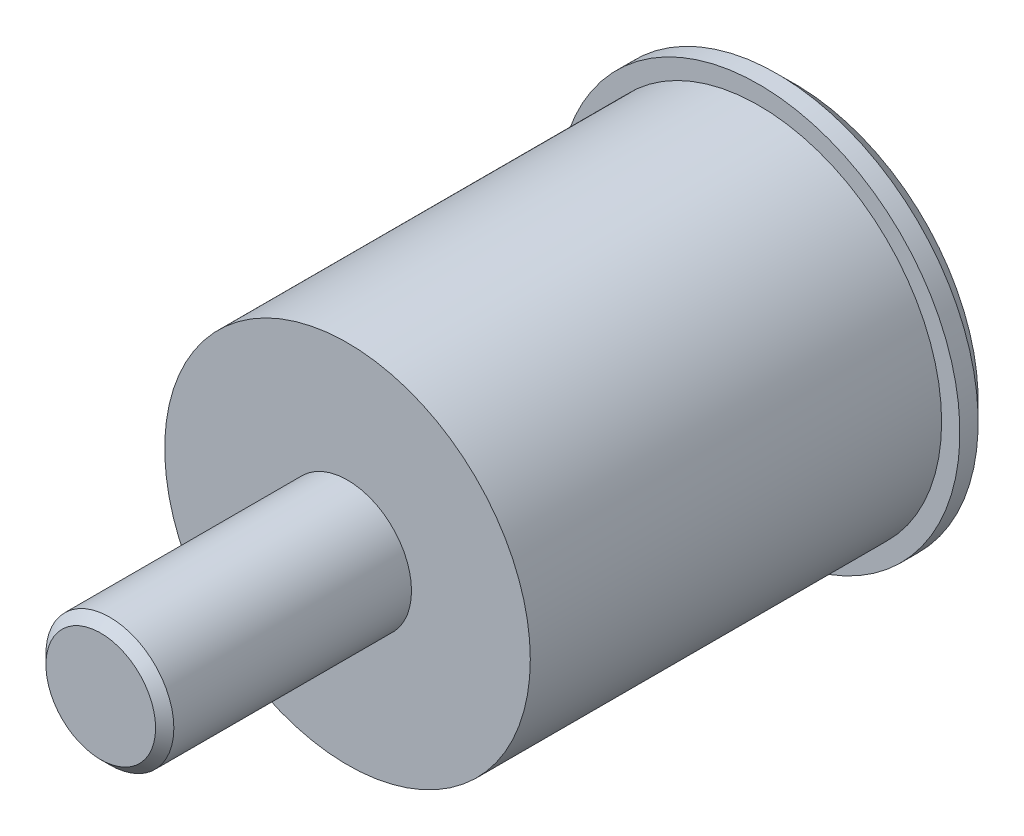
from build123d import *

# Parameters (mm, degrees)
ESQUISSE1_R             = 10
BASE_EXTRUSION_DEPTH    = 22.5
ESQUISSE2_R             = 3.5
BOSS_EXTRU_1_DEPTH      = 13.5
ESQUISSE3_R             = 11
BOSS_EXTRU_2_DEPTH      = 2
CHANFREIN1_SIZE         = 1
ESQUISSE4_W             = 9
ESQUISSE4_H             = 2
ENL_V_MAT_EXTRU_1_DEPTH = 20
CHANFREIN2_SIZE         = 0.5


with BuildPart() as part:
    # Esquisse1 → Base-Extrusion (new body)
    with BuildSketch(Plane.XY):
        Circle(ESQUISSE1_R)
    extrude(amount=-BASE_EXTRUSION_DEPTH)

    # Esquisse2 → Boss.-Extru.1 (add)
    with BuildSketch(Plane.XY):
        Circle(ESQUISSE2_R)
    extrude(amount=BOSS_EXTRU_1_DEPTH)

    # Esquisse3 → Boss.-Extru.2 (add)
    with BuildSketch(Plane(origin=(0, 0, -22.5), x_dir=(-1, 0, 0), z_dir=(0, 0, -1))):
        Circle(ESQUISSE3_R)
    extrude(amount=BOSS_EXTRU_2_DEPTH)

    # Chanfrein1
    chanfrein1_edges = [part.edges().sort_by_distance(p)[0] for p in [
        (11, 0, -24.5),
    ]]
    chamfer(chanfrein1_edges, length=CHANFREIN1_SIZE)

    # Esquisse4 → Enl_v. mat.-Extru.1 (cut)
    with BuildSketch(Plane(origin=(0, 0, -24.5), x_dir=(-1, 0, 0), z_dir=(0, 0, -1))):
        Rectangle(ESQUISSE4_W, ESQUISSE4_H)
    extrude(amount=-ENL_V_MAT_EXTRU_1_DEPTH, mode=Mode.SUBTRACT)

    # Chanfrein2
    chanfrein2_edges = [part.edges().sort_by_distance(p)[0] for p in [
        (-3.5, 0, 13.5),
    ]]
    chamfer(chanfrein2_edges, length=CHANFREIN2_SIZE)


solid = part.part
